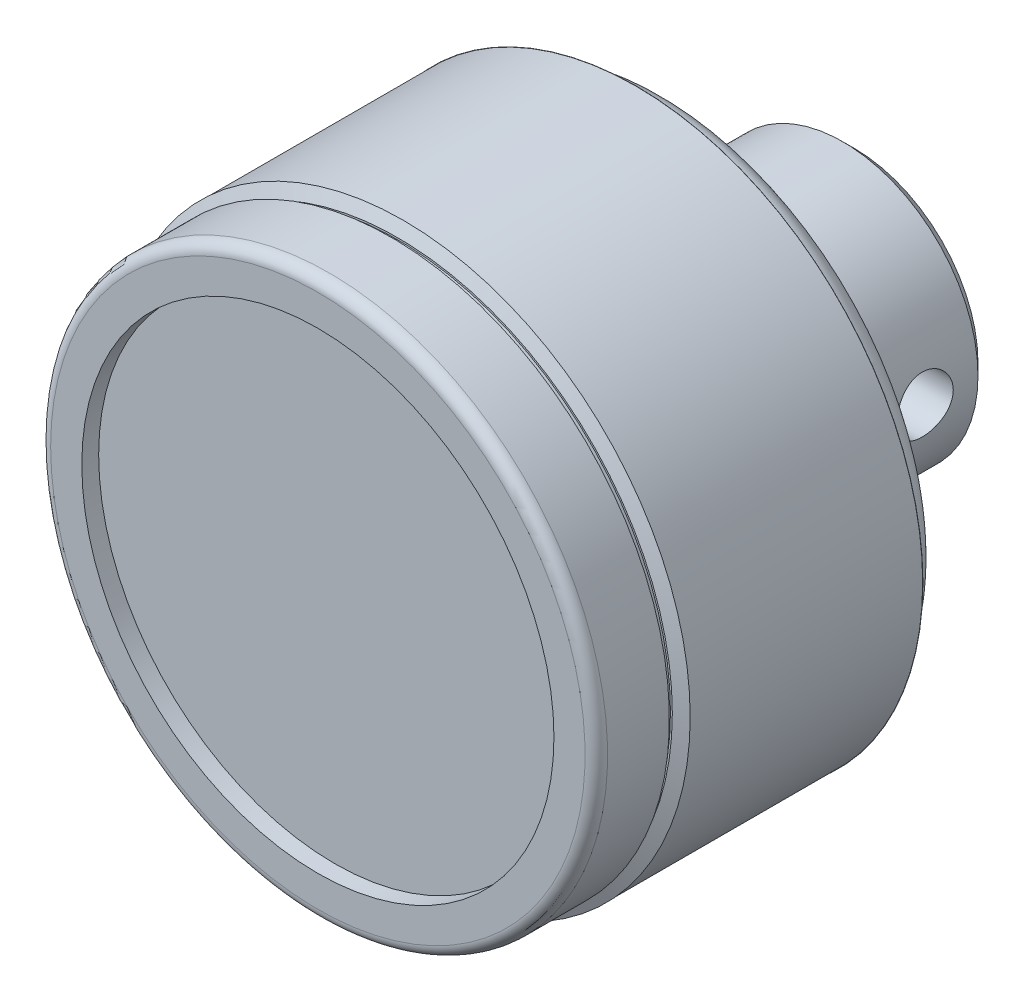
ISO-10303-21;
HEADER;
FILE_DESCRIPTION(('STEP AP214'),'2;1');
FILE_NAME('part.step','',(''),(''),'','','');
FILE_SCHEMA(('AUTOMOTIVE_DESIGN { 1 0 10303 214 1 1 1 1 }'));
ENDSEC;
DATA;
#1=APPLICATION_CONTEXT('core data for automotive mechanical design processes');
#2=APPLICATION_PROTOCOL_DEFINITION('international standard','automotive_design',2000,#1);
#3=PRODUCT_CONTEXT('',#1,'mechanical');
#4=PRODUCT('Part','Part','',(#3));
#5=PRODUCT_RELATED_PRODUCT_CATEGORY('part','',(#4));
#6=PRODUCT_DEFINITION_FORMATION('','',#4);
#7=PRODUCT_DEFINITION_CONTEXT('part definition',#1,'design');
#8=PRODUCT_DEFINITION('design','',#6,#7);
#9=PRODUCT_DEFINITION_SHAPE('','',#8);
#10=(LENGTH_UNIT() NAMED_UNIT(*) SI_UNIT(.MILLI.,.METRE.));
#11=(NAMED_UNIT(*) PLANE_ANGLE_UNIT() SI_UNIT($,.RADIAN.));
#12=(NAMED_UNIT(*) SI_UNIT($,.STERADIAN.) SOLID_ANGLE_UNIT());
#13=UNCERTAINTY_MEASURE_WITH_UNIT(LENGTH_MEASURE(1.E-05),#10,'distance_accuracy_value','');
#14=(GEOMETRIC_REPRESENTATION_CONTEXT(3) GLOBAL_UNCERTAINTY_ASSIGNED_CONTEXT((#13)) GLOBAL_UNIT_ASSIGNED_CONTEXT((#10,
#11,#12)) REPRESENTATION_CONTEXT('',''));
#15=CARTESIAN_POINT('',(0.,0.,0.));
#16=DIRECTION('',(0.,0.,1.));
#17=DIRECTION('',(1.,0.,0.));
#18=AXIS2_PLACEMENT_3D('',#15,#16,#17);
#19=CARTESIAN_POINT('',(0.,0.,47.));
#20=DIRECTION('',(0.,0.,1.));
#21=DIRECTION('',(-1.,0.,0.));
#22=AXIS2_PLACEMENT_3D('',#19,#20,#21);
#23=TOROIDAL_SURFACE('',#22,23.769615,1.);
#24=CARTESIAN_POINT('',(0.,0.,47.));
#25=DIRECTION('',(0.,0.,1.));
#26=DIRECTION('',(-1.,0.,0.));
#27=AXIS2_PLACEMENT_3D('',#24,#25,#26);
#28=CIRCLE('',#27,24.769615);
#29=CARTESIAN_POINT('',(-24.769615,0.,47.));
#30=VERTEX_POINT('',#29);
#31=EDGE_CURVE('E8',#30,#30,#28,.T.);
#32=ORIENTED_EDGE('',*,*,#31,.T.);
#33=EDGE_LOOP('',(#32));
#34=FACE_BOUND('',#33,.T.);
#35=CARTESIAN_POINT('',(0.,0.,48.));
#36=DIRECTION('',(0.,0.,1.));
#37=DIRECTION('',(-1.,0.,0.));
#38=AXIS2_PLACEMENT_3D('',#35,#36,#37);
#39=CIRCLE('',#38,23.769615);
#40=CARTESIAN_POINT('',(-23.769615,0.,48.));
#41=VERTEX_POINT('',#40);
#42=EDGE_CURVE('E78',#41,#41,#39,.T.);
#43=ORIENTED_EDGE('',*,*,#42,.F.);
#44=EDGE_LOOP('',(#43));
#45=FACE_BOUND('',#44,.T.);
#46=ADVANCED_FACE('F12',(#34,#45),#23,.T.);
#47=CARTESIAN_POINT('',(0.,0.,55.4489003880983));
#48=DIRECTION('',(0.,0.,1.));
#49=DIRECTION('',(-1.,0.,0.));
#50=AXIS2_PLACEMENT_3D('',#47,#48,#49);
#51=CYLINDRICAL_SURFACE('',#50,24.769615);
#52=CARTESIAN_POINT('',(0.,0.,41.5));
#53=DIRECTION('',(0.,0.,1.));
#54=DIRECTION('',(-1.,0.,0.));
#55=AXIS2_PLACEMENT_3D('',#52,#53,#54);
#56=CIRCLE('',#55,24.769615);
#57=CARTESIAN_POINT('',(-24.769615,0.,41.5));
#58=VERTEX_POINT('',#57);
#59=EDGE_CURVE('E24',#58,#58,#56,.T.);
#60=ORIENTED_EDGE('',*,*,#59,.T.);
#61=EDGE_LOOP('',(#60));
#62=FACE_BOUND('',#61,.T.);
#63=ORIENTED_EDGE('',*,*,#31,.F.);
#64=EDGE_LOOP('',(#63));
#65=FACE_BOUND('',#64,.T.);
#66=ADVANCED_FACE('F147',(#62,#65),#51,.T.);
#67=CARTESIAN_POINT('',(0.,24.769615,41.5));
#68=DIRECTION('',(0.,0.,-1.));
#69=DIRECTION('',(1.,0.,0.));
#70=AXIS2_PLACEMENT_3D('',#67,#68,#69);
#71=PLANE('',#70);
#72=CARTESIAN_POINT('',(0.,0.,41.5));
#73=DIRECTION('',(0.,0.,1.));
#74=DIRECTION('',(-1.,0.,0.));
#75=AXIS2_PLACEMENT_3D('',#72,#73,#74);
#76=CIRCLE('',#75,24.264145);
#77=CARTESIAN_POINT('',(-24.264145,0.,41.5));
#78=VERTEX_POINT('',#77);
#79=EDGE_CURVE('E28',#78,#78,#76,.T.);
#80=ORIENTED_EDGE('',*,*,#79,.T.);
#81=EDGE_LOOP('',(#80));
#82=FACE_BOUND('',#81,.T.);
#83=ORIENTED_EDGE('',*,*,#59,.F.);
#84=EDGE_LOOP('',(#83));
#85=FACE_BOUND('',#84,.T.);
#86=ADVANCED_FACE('F152',(#82,#85),#71,.T.);
#87=CARTESIAN_POINT('',(0.,0.,55.4489003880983));
#88=DIRECTION('',(0.,0.,1.));
#89=DIRECTION('',(-1.,0.,0.));
#90=AXIS2_PLACEMENT_3D('',#87,#88,#89);
#91=CYLINDRICAL_SURFACE('',#90,24.264145);
#92=CARTESIAN_POINT('',(0.,0.,40.9));
#93=DIRECTION('',(0.,0.,1.));
#94=DIRECTION('',(-1.,0.,0.));
#95=AXIS2_PLACEMENT_3D('',#92,#93,#94);
#96=CIRCLE('',#95,24.264145);
#97=CARTESIAN_POINT('',(-24.264145,0.,40.9));
#98=VERTEX_POINT('',#97);
#99=EDGE_CURVE('E33',#98,#98,#96,.T.);
#100=ORIENTED_EDGE('',*,*,#99,.T.);
#101=EDGE_LOOP('',(#100));
#102=FACE_BOUND('',#101,.T.);
#103=ORIENTED_EDGE('',*,*,#79,.F.);
#104=EDGE_LOOP('',(#103));
#105=FACE_BOUND('',#104,.T.);
#106=ADVANCED_FACE('F161',(#102,#105),#91,.T.);
#107=CARTESIAN_POINT('',(0.,24.430602,40.9));
#108=DIRECTION('',(0.,0.,-1.));
#109=DIRECTION('',(1.,0.,0.));
#110=AXIS2_PLACEMENT_3D('',#107,#108,#109);
#111=PLANE('',#110);
#112=ORIENTED_EDGE('',*,*,#99,.F.);
#113=EDGE_LOOP('',(#112));
#114=FACE_BOUND('',#113,.T.);
#115=CARTESIAN_POINT('',(0.,0.,40.9));
#116=DIRECTION('',(0.,0.,1.));
#117=DIRECTION('',(-1.,0.,0.));
#118=AXIS2_PLACEMENT_3D('',#115,#116,#117);
#119=CIRCLE('',#118,24.430602);
#120=CARTESIAN_POINT('',(-24.430602,0.,40.9));
#121=VERTEX_POINT('',#120);
#122=EDGE_CURVE('E36',#121,#121,#119,.T.);
#123=ORIENTED_EDGE('',*,*,#122,.T.);
#124=EDGE_LOOP('',(#123));
#125=FACE_BOUND('',#124,.T.);
#126=ADVANCED_FACE('F168',(#114,#125),#111,.F.);
#127=CARTESIAN_POINT('',(0.,0.,40.9));
#128=DIRECTION('',(0.,0.,-1.));
#129=DIRECTION('',(1.,0.,0.));
#130=AXIS2_PLACEMENT_3D('',#127,#128,#129);
#131=CONICAL_SURFACE('',#130,24.430602,1.14037477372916);
#132=CARTESIAN_POINT('',(0.,0.,40.4));
#133=DIRECTION('',(0.,0.,1.));
#134=DIRECTION('',(-1.,0.,0.));
#135=AXIS2_PLACEMENT_3D('',#132,#133,#134);
#136=CIRCLE('',#135,25.519615);
#137=CARTESIAN_POINT('',(-25.519615,0.,40.4));
#138=VERTEX_POINT('',#137);
#139=EDGE_CURVE('E39',#138,#138,#136,.T.);
#140=ORIENTED_EDGE('',*,*,#139,.T.);
#141=EDGE_LOOP('',(#140));
#142=FACE_BOUND('',#141,.T.);
#143=ORIENTED_EDGE('',*,*,#122,.F.);
#144=EDGE_LOOP('',(#143));
#145=FACE_BOUND('',#144,.T.);
#146=ADVANCED_FACE('F172',(#142,#145),#131,.T.);
#147=CARTESIAN_POINT('',(0.,25.5,40.4));
#148=DIRECTION('',(0.,0.,1.));
#149=DIRECTION('',(-1.,0.,0.));
#150=AXIS2_PLACEMENT_3D('',#147,#148,#149);
#151=PLANE('',#150);
#152=ORIENTED_EDGE('',*,*,#139,.F.);
#153=EDGE_LOOP('',(#152));
#154=FACE_BOUND('',#153,.T.);
#155=CARTESIAN_POINT('',(0.,0.,40.4));
#156=DIRECTION('',(0.,0.,1.));
#157=DIRECTION('',(-1.,0.,0.));
#158=AXIS2_PLACEMENT_3D('',#155,#156,#157);
#159=CIRCLE('',#158,25.5);
#160=CARTESIAN_POINT('',(-25.5,0.,40.4));
#161=VERTEX_POINT('',#160);
#162=EDGE_CURVE('E42',#161,#161,#159,.T.);
#163=ORIENTED_EDGE('',*,*,#162,.T.);
#164=EDGE_LOOP('',(#163));
#165=FACE_BOUND('',#164,.T.);
#166=ADVANCED_FACE('F176',(#154,#165),#151,.F.);
#167=CARTESIAN_POINT('',(0.,0.,55.4489003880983));
#168=DIRECTION('',(0.,0.,1.));
#169=DIRECTION('',(-1.,0.,0.));
#170=AXIS2_PLACEMENT_3D('',#167,#168,#169);
#171=CYLINDRICAL_SURFACE('',#170,25.5);
#172=CARTESIAN_POINT('',(0.,0.,19.7));
#173=DIRECTION('',(0.,0.,1.));
#174=DIRECTION('',(-1.,0.,0.));
#175=AXIS2_PLACEMENT_3D('',#172,#173,#174);
#176=CIRCLE('',#175,25.5);
#177=CARTESIAN_POINT('',(-25.5,0.,19.7));
#178=VERTEX_POINT('',#177);
#179=EDGE_CURVE('E45',#178,#178,#176,.T.);
#180=ORIENTED_EDGE('',*,*,#179,.T.);
#181=EDGE_LOOP('',(#180));
#182=FACE_BOUND('',#181,.T.);
#183=ORIENTED_EDGE('',*,*,#162,.F.);
#184=EDGE_LOOP('',(#183));
#185=FACE_BOUND('',#184,.T.);
#186=ADVANCED_FACE('F180',(#182,#185),#171,.T.);
#187=CARTESIAN_POINT('',(0.,25.5,19.7));
#188=DIRECTION('',(0.,0.,1.));
#189=DIRECTION('',(-1.,0.,0.));
#190=AXIS2_PLACEMENT_3D('',#187,#188,#189);
#191=PLANE('',#190);
#192=CARTESIAN_POINT('',(0.,0.,19.7));
#193=DIRECTION('',(0.,0.,1.));
#194=DIRECTION('',(-1.,0.,0.));
#195=AXIS2_PLACEMENT_3D('',#192,#193,#194);
#196=CIRCLE('',#195,25.519615);
#197=CARTESIAN_POINT('',(-25.519615,0.,19.7));
#198=VERTEX_POINT('',#197);
#199=EDGE_CURVE('E48',#198,#198,#196,.T.);
#200=ORIENTED_EDGE('',*,*,#199,.T.);
#201=EDGE_LOOP('',(#200));
#202=FACE_BOUND('',#201,.T.);
#203=ORIENTED_EDGE('',*,*,#179,.F.);
#204=EDGE_LOOP('',(#203));
#205=FACE_BOUND('',#204,.T.);
#206=ADVANCED_FACE('F184',(#202,#205),#191,.T.);
#207=CARTESIAN_POINT('',(0.,0.,19.7));
#208=DIRECTION('',(0.,0.,1.));
#209=DIRECTION('',(-1.,0.,0.));
#210=AXIS2_PLACEMENT_3D('',#207,#208,#209);
#211=CONICAL_SURFACE('',#210,25.519615,1.1165546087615);
#212=CARTESIAN_POINT('',(0.,0.,19.0860529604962));
#213=DIRECTION('',(0.,0.,1.));
#214=DIRECTION('',(-1.,0.,0.));
#215=AXIS2_PLACEMENT_3D('',#212,#213,#214);
#216=CIRCLE('',#215,24.2622928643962);
#217=CARTESIAN_POINT('',(-24.2622928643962,0.,19.0860529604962));
#218=VERTEX_POINT('',#217);
#219=EDGE_CURVE('E51',#218,#218,#216,.T.);
#220=ORIENTED_EDGE('',*,*,#219,.T.);
#221=EDGE_LOOP('',(#220));
#222=FACE_BOUND('',#221,.T.);
#223=ORIENTED_EDGE('',*,*,#199,.F.);
#224=EDGE_LOOP('',(#223));
#225=FACE_BOUND('',#224,.T.);
#226=ADVANCED_FACE('F188',(#222,#225),#211,.T.);
#227=CARTESIAN_POINT('',(0.,0.,19.));
#228=DIRECTION('',(0.,0.,1.));
#229=DIRECTION('',(-1.,0.,0.));
#230=AXIS2_PLACEMENT_3D('',#227,#228,#229);
#231=TOROIDAL_SURFACE('',#230,22.264145,2.0000000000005);
#232=CARTESIAN_POINT('',(0.,0.,17.));
#233=DIRECTION('',(0.,0.,1.));
#234=DIRECTION('',(-1.,0.,0.));
#235=AXIS2_PLACEMENT_3D('',#232,#233,#234);
#236=CIRCLE('',#235,22.264147);
#237=CARTESIAN_POINT('',(-22.264147,0.,17.));
#238=VERTEX_POINT('',#237);
#239=EDGE_CURVE('E54',#238,#238,#236,.T.);
#240=ORIENTED_EDGE('',*,*,#239,.T.);
#241=EDGE_LOOP('',(#240));
#242=FACE_BOUND('',#241,.T.);
#243=ORIENTED_EDGE('',*,*,#219,.F.);
#244=EDGE_LOOP('',(#243));
#245=FACE_BOUND('',#244,.T.);
#246=ADVANCED_FACE('F192',(#242,#245),#231,.T.);
#247=CARTESIAN_POINT('',(0.,15.019615,17.));
#248=DIRECTION('',(0.,0.,1.));
#249=DIRECTION('',(-1.,0.,0.));
#250=AXIS2_PLACEMENT_3D('',#247,#248,#249);
#251=PLANE('',#250);
#252=ORIENTED_EDGE('',*,*,#239,.F.);
#253=EDGE_LOOP('',(#252));
#254=FACE_BOUND('',#253,.T.);
#255=CARTESIAN_POINT('',(0.,0.,17.));
#256=DIRECTION('',(0.,0.,1.));
#257=DIRECTION('',(-1.,0.,0.));
#258=AXIS2_PLACEMENT_3D('',#255,#256,#257);
#259=CIRCLE('',#258,15.019615);
#260=CARTESIAN_POINT('',(-15.019615,0.,17.));
#261=VERTEX_POINT('',#260);
#262=EDGE_CURVE('E57',#261,#261,#259,.T.);
#263=ORIENTED_EDGE('',*,*,#262,.T.);
#264=EDGE_LOOP('',(#263));
#265=FACE_BOUND('',#264,.T.);
#266=ADVANCED_FACE('F196',(#254,#265),#251,.F.);
#267=CARTESIAN_POINT('',(0.,0.,14.));
#268=DIRECTION('',(0.,0.,1.));
#269=DIRECTION('',(-1.,0.,0.));
#270=AXIS2_PLACEMENT_3D('',#267,#268,#269);
#271=TOROIDAL_SURFACE('',#270,15.019615,3.);
#272=ORIENTED_EDGE('',*,*,#262,.F.);
#273=EDGE_LOOP('',(#272));
#274=FACE_BOUND('',#273,.T.);
#275=CARTESIAN_POINT('',(0.,0.,14.));
#276=DIRECTION('',(0.,0.,1.));
#277=DIRECTION('',(-1.,0.,0.));
#278=AXIS2_PLACEMENT_3D('',#275,#276,#277);
#279=CIRCLE('',#278,12.019615);
#280=CARTESIAN_POINT('',(-12.019615,0.,14.));
#281=VERTEX_POINT('',#280);
#282=EDGE_CURVE('E60',#281,#281,#279,.T.);
#283=ORIENTED_EDGE('',*,*,#282,.T.);
#284=EDGE_LOOP('',(#283));
#285=FACE_BOUND('',#284,.T.);
#286=ADVANCED_FACE('F142',(#274,#285),#271,.F.);
#287=CARTESIAN_POINT('',(0.,0.,55.4489003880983));
#288=DIRECTION('',(0.,0.,1.));
#289=DIRECTION('',(-1.,0.,0.));
#290=AXIS2_PLACEMENT_3D('',#287,#288,#289);
#291=CYLINDRICAL_SURFACE('',#290,12.019615);
#292=CARTESIAN_POINT('',(12.019615,0.,3.5));
#293=CARTESIAN_POINT('',(12.0196124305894,0.138823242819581,3.50000496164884));
#294=CARTESIAN_POINT('',(12.0171853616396,0.27770803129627,3.51160219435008));
#295=CARTESIAN_POINT('',(12.0077375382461,0.551543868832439,3.55764316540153));
#296=CARTESIAN_POINT('',(12.0007132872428,0.686491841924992,3.59210429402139));
#297=CARTESIAN_POINT('',(11.9828545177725,0.94845596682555,3.68275595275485));
#298=CARTESIAN_POINT('',(11.9720237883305,1.07547985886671,3.73892488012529));
#299=CARTESIAN_POINT('',(11.9477259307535,1.31829380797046,3.87133166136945));
#300=CARTESIAN_POINT('',(11.9342589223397,1.43408437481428,3.94756860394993));
#301=CARTESIAN_POINT('',(11.9059481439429,1.65284104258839,4.11912557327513));
#302=CARTESIAN_POINT('',(11.8910886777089,1.75561970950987,4.21468203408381));
#303=CARTESIAN_POINT('',(11.8617804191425,1.94381114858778,4.42165755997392));
#304=CARTESIAN_POINT('',(11.8473316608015,2.02922248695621,4.53307793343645));
#305=CARTESIAN_POINT('',(11.820326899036,2.18106471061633,4.7699824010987));
#306=CARTESIAN_POINT('',(11.8077910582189,2.24729924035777,4.8955948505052));
#307=CARTESIAN_POINT('',(11.7862554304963,2.35764910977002,5.15647016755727));
#308=CARTESIAN_POINT('',(11.7772552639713,2.40176682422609,5.29173199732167));
#309=CARTESIAN_POINT('',(11.7639692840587,2.4660176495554,5.56604282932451));
#310=CARTESIAN_POINT('',(11.7596186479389,2.48648088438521,5.70501130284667));
#311=CARTESIAN_POINT('',(11.7559293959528,2.50386772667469,5.98447180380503));
#312=CARTESIAN_POINT('',(11.7565902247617,2.50079394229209,6.12496366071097));
#313=CARTESIAN_POINT('',(11.7627904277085,2.47146038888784,6.4010515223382));
#314=CARTESIAN_POINT('',(11.7682497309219,2.44558115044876,6.53669002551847));
#315=CARTESIAN_POINT('',(11.7833054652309,2.37197288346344,6.80165713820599));
#316=CARTESIAN_POINT('',(11.7929021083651,2.32424273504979,6.93098542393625));
#317=CARTESIAN_POINT('',(11.815231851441,2.20793001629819,7.1807463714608));
#318=CARTESIAN_POINT('',(11.8279872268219,2.13919850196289,7.30110759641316));
#319=CARTESIAN_POINT('',(11.8551831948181,1.9829390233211,7.52873024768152));
#320=CARTESIAN_POINT('',(11.8696239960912,1.89540873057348,7.63599004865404));
#321=CARTESIAN_POINT('',(11.8989092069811,1.70200854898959,7.83655887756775));
#322=CARTESIAN_POINT('',(11.913755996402,1.59581437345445,7.92955514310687));
#323=CARTESIAN_POINT('',(11.9419231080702,1.36917356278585,8.09646603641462));
#324=CARTESIAN_POINT('',(11.9552434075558,1.2487267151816,8.17038037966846));
#325=CARTESIAN_POINT('',(11.9788936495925,0.996637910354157,8.29709516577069));
#326=CARTESIAN_POINT('',(11.9892182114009,0.864976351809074,8.34985768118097));
#327=CARTESIAN_POINT('',(12.005673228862,0.594394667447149,8.43242589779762));
#328=CARTESIAN_POINT('',(12.0118042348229,0.455475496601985,8.46223461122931));
#329=CARTESIAN_POINT('',(12.0191039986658,0.177007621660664,8.49760122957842));
#330=CARTESIAN_POINT('',(12.0203602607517,0.0375154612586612,8.50358682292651));
#331=CARTESIAN_POINT('',(12.0180129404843,-0.240475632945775,8.49229219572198));
#332=CARTESIAN_POINT('',(12.0144096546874,-0.378974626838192,8.47501339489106));
#333=CARTESIAN_POINT('',(12.0028030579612,-0.649652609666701,8.41803553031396));
#334=CARTESIAN_POINT('',(11.9948432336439,-0.781880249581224,8.37855794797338));
#335=CARTESIAN_POINT('',(11.9754134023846,-1.03783835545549,8.278546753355));
#336=CARTESIAN_POINT('',(11.9639431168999,-1.16156814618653,8.21801147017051));
#337=CARTESIAN_POINT('',(11.9385475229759,-1.39880742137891,8.07669226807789));
#338=CARTESIAN_POINT('',(11.9245920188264,-1.51216176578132,7.99565345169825));
#339=CARTESIAN_POINT('',(11.8958409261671,-1.72381618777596,7.81596650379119));
#340=CARTESIAN_POINT('',(11.8810452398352,-1.82211450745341,7.71731631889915));
#341=CARTESIAN_POINT('',(11.8519833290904,-2.00253408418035,7.50325324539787));
#342=CARTESIAN_POINT('',(11.837729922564,-2.08436063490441,7.38758991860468));
#343=CARTESIAN_POINT('',(11.8116478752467,-2.22742655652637,7.14390987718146));
#344=CARTESIAN_POINT('',(11.7998191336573,-2.28866678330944,7.01589367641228));
#345=CARTESIAN_POINT('',(11.7800312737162,-2.388429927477,6.7518073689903));
#346=CARTESIAN_POINT('',(11.7720513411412,-2.42707528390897,6.61578515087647));
#347=CARTESIAN_POINT('',(11.7608230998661,-2.48091815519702,6.33899252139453));
#348=CARTESIAN_POINT('',(11.7575741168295,-2.49611901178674,6.19822278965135));
#349=CARTESIAN_POINT('',(11.7562152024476,-2.50250989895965,5.91889501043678));
#350=CARTESIAN_POINT('',(11.758005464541,-2.49416624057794,5.78034790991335));
#351=CARTESIAN_POINT('',(11.7662991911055,-2.45473964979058,5.50667909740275));
#352=CARTESIAN_POINT('',(11.7728026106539,-2.42365693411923,5.37155735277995));
#353=CARTESIAN_POINT('',(11.7897435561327,-2.33984988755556,5.10890229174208));
#354=CARTESIAN_POINT('',(11.8001698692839,-2.28718720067,4.98134853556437));
#355=CARTESIAN_POINT('',(11.823787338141,-2.16177052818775,4.73681555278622));
#356=CARTESIAN_POINT('',(11.8369787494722,-2.08901468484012,4.61983730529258));
#357=CARTESIAN_POINT('',(11.8649424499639,-1.92390346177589,4.3974635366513));
#358=CARTESIAN_POINT('',(11.8797392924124,-1.83121314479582,4.29231974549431));
#359=CARTESIAN_POINT('',(11.9090751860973,-1.62955045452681,4.09892488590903));
#360=CARTESIAN_POINT('',(11.9236141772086,-1.52057433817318,4.01067771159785));
#361=CARTESIAN_POINT('',(11.9509936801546,-1.2879270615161,3.85261798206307));
#362=CARTESIAN_POINT('',(11.9638127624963,-1.16410147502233,3.7830288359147));
#363=CARTESIAN_POINT('',(11.9860956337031,-0.906276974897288,3.66575889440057));
#364=CARTESIAN_POINT('',(11.9955623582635,-0.772287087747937,3.61805891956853));
#365=CARTESIAN_POINT('',(12.0082968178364,-0.531719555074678,3.55485453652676));
#366=CARTESIAN_POINT('',(12.0125156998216,-0.426484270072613,3.53432181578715));
#367=CARTESIAN_POINT('',(12.0181757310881,-0.21417815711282,3.50689288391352));
#368=CARTESIAN_POINT('',(12.0196169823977,-0.107107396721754,3.49999617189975));
#369=CARTESIAN_POINT('',(12.019615,0.,3.5));
#370=B_SPLINE_CURVE_WITH_KNOTS('',3,(#292,#293,#294,#295,#296,#297,#298,#299,#300,#301,#302,
#303,#304,#305,#306,#307,#308,#309,#310,#311,#312,#313,#314,#315,#316,#317,#318,#319,#320,#321,
#322,#323,#324,#325,#326,#327,#328,#329,#330,#331,#332,#333,#334,#335,#336,#337,#338,#339,#340,
#341,#342,#343,#344,#345,#346,#347,#348,#349,#350,#351,#352,#353,#354,#355,#356,#357,#358,#359,
#360,#361,#362,#363,#364,#365,#366,#367,#368,#369),.UNSPECIFIED.,.T.,.F.,(4,2,2,2,2,2,2,2,2,2,2,
2,2,2,2,2,2,2,2,2,2,2,2,2,2,2,2,2,2,2,2,2,2,2,2,2,2,2,4),(0.,0.416077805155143,
0.832472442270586,1.2484537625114,1.66441619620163,2.08581626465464,2.50725110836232,
2.93285974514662,3.35842267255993,3.77797183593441,4.19747450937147,4.6101071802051,
5.02276100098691,5.43841214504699,5.85411480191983,6.27792221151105,6.70173593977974,
7.12630624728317,7.5508208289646,7.96767891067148,8.38451155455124,8.79725734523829,
9.21003589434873,9.62822247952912,10.0464578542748,10.4716161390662,10.8967567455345,
11.3195716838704,11.7423263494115,12.156767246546,12.5712041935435,12.984465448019,
13.3977649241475,13.818643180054,14.239618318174,14.6654293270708,15.0908665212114,
15.4118981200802,15.732917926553),.UNSPECIFIED.);
#371=CARTESIAN_POINT('',(12.019615,0.,3.5));
#372=VERTEX_POINT('',#371);
#373=EDGE_CURVE('E87',#372,#372,#370,.T.);
#374=ORIENTED_EDGE('',*,*,#373,.F.);
#375=EDGE_LOOP('',(#374));
#376=FACE_BOUND('',#375,.T.);
#377=CARTESIAN_POINT('',(0.,0.,1.3));
#378=DIRECTION('',(0.,0.,1.));
#379=DIRECTION('',(-1.,0.,0.));
#380=AXIS2_PLACEMENT_3D('',#377,#378,#379);
#381=CIRCLE('',#380,12.019615);
#382=CARTESIAN_POINT('',(-12.019615,0.,1.3));
#383=VERTEX_POINT('',#382);
#384=EDGE_CURVE('E63',#383,#383,#381,.T.);
#385=ORIENTED_EDGE('',*,*,#384,.T.);
#386=EDGE_LOOP('',(#385));
#387=FACE_BOUND('',#386,.T.);
#388=ORIENTED_EDGE('',*,*,#282,.F.);
#389=EDGE_LOOP('',(#388));
#390=FACE_BOUND('',#389,.T.);
#391=ADVANCED_FACE('F95',(#376,#387,#390),#291,.T.);
#392=CARTESIAN_POINT('',(0.,0.,0.299999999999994));
#393=DIRECTION('',(0.,0.,1.));
#394=DIRECTION('',(-1.,0.,0.));
#395=AXIS2_PLACEMENT_3D('',#392,#393,#394);
#396=CONICAL_SURFACE('',#395,11.019615,0.785398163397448);
#397=ORIENTED_EDGE('',*,*,#384,.F.);
#398=EDGE_LOOP('',(#397));
#399=FACE_BOUND('',#398,.T.);
#400=CARTESIAN_POINT('',(0.,0.,0.299999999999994));
#401=DIRECTION('',(0.,0.,1.));
#402=DIRECTION('',(-1.,0.,0.));
#403=AXIS2_PLACEMENT_3D('',#400,#401,#402);
#404=CIRCLE('',#403,11.019615);
#405=CARTESIAN_POINT('',(-11.019615,0.,0.299999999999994));
#406=VERTEX_POINT('',#405);
#407=EDGE_CURVE('E66',#406,#406,#404,.T.);
#408=ORIENTED_EDGE('',*,*,#407,.T.);
#409=EDGE_LOOP('',(#408));
#410=FACE_BOUND('',#409,.T.);
#411=ADVANCED_FACE('F133',(#399,#410),#396,.T.);
#412=CARTESIAN_POINT('',(0.,9.019615,0.299999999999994));
#413=DIRECTION('',(0.,0.,1.));
#414=DIRECTION('',(-1.,0.,0.));
#415=AXIS2_PLACEMENT_3D('',#412,#413,#414);
#416=PLANE('',#415);
#417=ORIENTED_EDGE('',*,*,#407,.F.);
#418=EDGE_LOOP('',(#417));
#419=FACE_BOUND('',#418,.T.);
#420=CARTESIAN_POINT('',(0.,0.,0.299999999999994));
#421=DIRECTION('',(0.,0.,1.));
#422=DIRECTION('',(-1.,0.,0.));
#423=AXIS2_PLACEMENT_3D('',#420,#421,#422);
#424=CIRCLE('',#423,9.019615);
#425=CARTESIAN_POINT('',(-9.019615,0.,0.299999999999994));
#426=VERTEX_POINT('',#425);
#427=EDGE_CURVE('E69',#426,#426,#424,.T.);
#428=ORIENTED_EDGE('',*,*,#427,.T.);
#429=EDGE_LOOP('',(#428));
#430=FACE_BOUND('',#429,.T.);
#431=ADVANCED_FACE('F130',(#419,#430),#416,.F.);
#432=CARTESIAN_POINT('',(0.,0.,55.4489003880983));
#433=DIRECTION('',(0.,0.,1.));
#434=DIRECTION('',(-1.,0.,0.));
#435=AXIS2_PLACEMENT_3D('',#432,#433,#434);
#436=CYLINDRICAL_SURFACE('',#435,9.019615);
#437=CARTESIAN_POINT('',(0.,0.,0.));
#438=DIRECTION('',(0.,0.,1.));
#439=DIRECTION('',(-1.,0.,0.));
#440=AXIS2_PLACEMENT_3D('',#437,#438,#439);
#441=CIRCLE('',#440,9.019615);
#442=CARTESIAN_POINT('',(-9.019615,0.,0.));
#443=VERTEX_POINT('',#442);
#444=EDGE_CURVE('E72',#443,#443,#441,.T.);
#445=ORIENTED_EDGE('',*,*,#444,.T.);
#446=EDGE_LOOP('',(#445));
#447=FACE_BOUND('',#446,.T.);
#448=ORIENTED_EDGE('',*,*,#427,.F.);
#449=EDGE_LOOP('',(#448));
#450=FACE_BOUND('',#449,.T.);
#451=ADVANCED_FACE('F126',(#447,#450),#436,.T.);
#452=CARTESIAN_POINT('',(0.,4.,0.));
#453=DIRECTION('',(0.,0.,1.));
#454=DIRECTION('',(-1.,0.,0.));
#455=AXIS2_PLACEMENT_3D('',#452,#453,#454);
#456=PLANE('',#455);
#457=ORIENTED_EDGE('',*,*,#444,.F.);
#458=EDGE_LOOP('',(#457));
#459=FACE_BOUND('',#458,.T.);
#460=CARTESIAN_POINT('',(0.,0.,0.));
#461=DIRECTION('',(0.,0.,1.));
#462=DIRECTION('',(-1.,0.,0.));
#463=AXIS2_PLACEMENT_3D('',#460,#461,#462);
#464=CIRCLE('',#463,4.);
#465=CARTESIAN_POINT('',(-4.,0.,0.));
#466=VERTEX_POINT('',#465);
#467=EDGE_CURVE('E75',#466,#466,#464,.T.);
#468=ORIENTED_EDGE('',*,*,#467,.T.);
#469=EDGE_LOOP('',(#468));
#470=FACE_BOUND('',#469,.T.);
#471=ADVANCED_FACE('F122',(#459,#470),#456,.F.);
#472=CARTESIAN_POINT('',(0.,0.,55.4489003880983));
#473=DIRECTION('',(0.,0.,1.));
#474=DIRECTION('',(-1.,0.,0.));
#475=AXIS2_PLACEMENT_3D('',#472,#473,#474);
#476=CYLINDRICAL_SURFACE('',#475,4.);
#477=CARTESIAN_POINT('',(0.,0.,17.));
#478=DIRECTION('',(0.,0.,-1.));
#479=DIRECTION('',(-1.,0.,0.));
#480=AXIS2_PLACEMENT_3D('',#477,#478,#479);
#481=CIRCLE('',#480,4.);
#482=CARTESIAN_POINT('',(-4.,0.,17.));
#483=VERTEX_POINT('',#482);
#484=EDGE_CURVE('E94',#483,#483,#481,.T.);
#485=ORIENTED_EDGE('',*,*,#484,.F.);
#486=EDGE_LOOP('',(#485));
#487=FACE_BOUND('',#486,.T.);
#488=CARTESIAN_POINT('',(4.,0.,3.5));
#489=CARTESIAN_POINT('',(3.99999041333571,0.127017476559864,3.50001047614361));
#490=CARTESIAN_POINT('',(3.9938860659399,0.254191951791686,3.50974649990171));
#491=CARTESIAN_POINT('',(3.97004375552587,0.504637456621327,3.54817112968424));
#492=CARTESIAN_POINT('',(3.95228361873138,0.627900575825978,3.57689586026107));
#493=CARTESIAN_POINT('',(3.90691695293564,0.86641086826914,3.65162285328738));
#494=CARTESIAN_POINT('',(3.87935918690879,0.981694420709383,3.69753960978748));
#495=CARTESIAN_POINT('',(3.81669199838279,1.20252080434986,3.80477166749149));
#496=CARTESIAN_POINT('',(3.78158341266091,1.30806471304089,3.86608526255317));
#497=CARTESIAN_POINT('',(3.70340304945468,1.5159483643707,4.00777315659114));
#498=CARTESIAN_POINT('',(3.65991924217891,1.61735911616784,4.08927860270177));
#499=CARTESIAN_POINT('',(3.57062700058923,1.80597275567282,4.26643834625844));
#500=CARTESIAN_POINT('',(3.52481549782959,1.89315621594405,4.36211165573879));
#501=CARTESIAN_POINT('',(3.42860837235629,2.06285746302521,4.58006778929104));
#502=CARTESIAN_POINT('',(3.3784322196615,2.14314412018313,4.70419957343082));
#503=CARTESIAN_POINT('',(3.28660396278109,2.28147932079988,4.96712963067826));
#504=CARTESIAN_POINT('',(3.24493752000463,2.33956541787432,5.10590262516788));
#505=CARTESIAN_POINT('',(3.18619151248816,2.41866801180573,5.35762104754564));
#506=CARTESIAN_POINT('',(3.16553811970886,2.44539104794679,5.46793363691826));
#507=CARTESIAN_POINT('',(3.13562714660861,2.4836368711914,5.69261185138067));
#508=CARTESIAN_POINT('',(3.12635347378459,2.49518112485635,5.80697151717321));
#509=CARTESIAN_POINT('',(3.12059771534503,2.50237836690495,6.03682603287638));
#510=CARTESIAN_POINT('',(3.12414917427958,2.49798968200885,6.15232307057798));
#511=CARTESIAN_POINT('',(3.14354804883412,2.47352633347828,6.38062020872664));
#512=CARTESIAN_POINT('',(3.15940531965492,2.45343909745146,6.49341807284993));
#513=CARTESIAN_POINT('',(3.2006514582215,2.39936209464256,6.71087689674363));
#514=CARTESIAN_POINT('',(3.22581428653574,2.36570043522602,6.81566487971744));
#515=CARTESIAN_POINT('',(3.28291134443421,2.28580369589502,7.01832239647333));
#516=CARTESIAN_POINT('',(3.31484796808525,2.2395641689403,7.11618946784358));
#517=CARTESIAN_POINT('',(3.38909625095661,2.12589830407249,7.32166640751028));
#518=CARTESIAN_POINT('',(3.43223155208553,2.05612773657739,7.42768105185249));
#519=CARTESIAN_POINT('',(3.52011451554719,1.90176111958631,7.62766112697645));
#520=CARTESIAN_POINT('',(3.56486379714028,1.81714983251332,7.72161400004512));
#521=CARTESIAN_POINT('',(3.65959667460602,1.61904732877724,7.91060100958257));
#522=CARTESIAN_POINT('',(3.70922571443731,1.5030944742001,8.00325594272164));
#523=CARTESIAN_POINT('',(3.80056601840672,1.25426444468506,8.16771179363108));
#524=CARTESIAN_POINT('',(3.84228039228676,1.12139395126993,8.23952090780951));
#525=CARTESIAN_POINT('',(3.89435975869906,0.915775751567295,8.32734595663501));
#526=CARTESIAN_POINT('',(3.90966874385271,0.848193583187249,8.35283428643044));
#527=CARTESIAN_POINT('',(3.93701839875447,0.710492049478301,8.39800765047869));
#528=CARTESIAN_POINT('',(3.94906095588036,0.640374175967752,8.41769603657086));
#529=CARTESIAN_POINT('',(3.96949699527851,0.498239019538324,8.45093416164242));
#530=CARTESIAN_POINT('',(3.97789374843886,0.42622350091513,8.464489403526));
#531=CARTESIAN_POINT('',(3.99078766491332,0.280965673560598,8.4852462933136));
#532=CARTESIAN_POINT('',(3.99528549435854,0.207723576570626,8.49244902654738));
#533=CARTESIAN_POINT('',(4.00193773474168,0.00911917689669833,8.50310930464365));
#534=CARTESIAN_POINT('',(4.000238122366,-0.116782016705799,8.50040036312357));
#535=CARTESIAN_POINT('',(3.98518313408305,-0.36596776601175,8.47624033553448));
#536=CARTESIAN_POINT('',(3.97182855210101,-0.489252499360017,8.45479052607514));
#537=CARTESIAN_POINT('',(3.93547975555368,-0.72503619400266,8.39552141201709));
#538=CARTESIAN_POINT('',(3.91288306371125,-0.83776842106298,8.35837527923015));
#539=CARTESIAN_POINT('',(3.85991402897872,-1.05527816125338,8.26940762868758));
#540=CARTESIAN_POINT('',(3.82954038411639,-1.16005433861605,8.2175836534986));
#541=CARTESIAN_POINT('',(3.75980014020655,-1.37016761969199,8.0949694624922));
#542=CARTESIAN_POINT('',(3.71983526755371,-1.47449380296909,8.02279282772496));
#543=CARTESIAN_POINT('',(3.63613942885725,-1.67028541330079,7.86441230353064));
#544=CARTESIAN_POINT('',(3.59240430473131,-1.76173634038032,7.77819283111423));
#545=CARTESIAN_POINT('',(3.49811738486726,-1.9429483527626,7.57972991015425));
#546=CARTESIAN_POINT('',(3.44749766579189,-2.03053702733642,7.46552558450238));
#547=CARTESIAN_POINT('',(3.35133525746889,-2.18560704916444,7.22224843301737));
#548=CARTESIAN_POINT('',(3.30578906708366,-2.25310231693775,7.09318598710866));
#549=CARTESIAN_POINT('',(3.23467060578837,-2.35369543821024,6.85061570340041));
#550=CARTESIAN_POINT('',(3.20691272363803,-2.39103791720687,6.73951849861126));
#551=CARTESIAN_POINT('',(3.16210061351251,-2.45000216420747,6.51121370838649));
#552=CARTESIAN_POINT('',(3.14502966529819,-2.47164849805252,6.39401598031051));
#553=CARTESIAN_POINT('',(3.124126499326,-2.49802767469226,6.15581944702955));
#554=CARTESIAN_POINT('',(3.12037003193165,-2.50266374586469,6.03480283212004));
#555=CARTESIAN_POINT('',(3.12698126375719,-2.49439556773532,5.79373807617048));
#556=CARTESIAN_POINT('',(3.13735365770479,-2.48148548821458,5.67369027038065));
#557=CARTESIAN_POINT('',(3.1691077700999,-2.44076547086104,5.44794042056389));
#558=CARTESIAN_POINT('',(3.18953614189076,-2.41423847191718,5.34186143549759));
#559=CARTESIAN_POINT('',(3.23835062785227,-2.34835238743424,5.13572984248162));
#560=CARTESIAN_POINT('',(3.26674005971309,-2.30898795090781,5.03567976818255));
#561=CARTESIAN_POINT('',(3.33327797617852,-2.2120541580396,4.82880667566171));
#562=CARTESIAN_POINT('',(3.3722442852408,-2.15267427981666,4.72310005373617));
#563=CARTESIAN_POINT('',(3.45335445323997,-2.01999894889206,4.52212261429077));
#564=CARTESIAN_POINT('',(3.49550086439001,-1.94669224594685,4.42686033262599));
#565=CARTESIAN_POINT('',(3.5880367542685,-1.77134669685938,4.22997441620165));
#566=CARTESIAN_POINT('',(3.63840488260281,-1.66649284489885,4.13083023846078));
#567=CARTESIAN_POINT('',(3.73398053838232,-1.43961937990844,3.95099840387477));
#568=CARTESIAN_POINT('',(3.77918486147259,-1.31758921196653,3.87032217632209));
#569=CARTESIAN_POINT('',(3.83959214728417,-1.12346357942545,3.765436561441));
#570=CARTESIAN_POINT('',(3.8585183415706,-1.05679601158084,3.73312519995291));
#571=CARTESIAN_POINT('',(3.89335165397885,-0.920199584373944,3.67432774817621));
#572=CARTESIAN_POINT('',(3.90926051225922,-0.850272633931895,3.64783829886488));
#573=CARTESIAN_POINT('',(3.93753374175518,-0.707873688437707,3.60114285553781));
#574=CARTESIAN_POINT('',(3.94990764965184,-0.635409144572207,3.58091994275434));
#575=CARTESIAN_POINT('',(3.97075677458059,-0.488456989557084,3.54702454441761));
#576=CARTESIAN_POINT('',(3.97923486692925,-0.413970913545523,3.53334722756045));
#577=CARTESIAN_POINT('',(3.99038271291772,-0.282852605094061,3.51540958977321));
#578=CARTESIAN_POINT('',(3.99398159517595,-0.226501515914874,3.50963846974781));
#579=CARTESIAN_POINT('',(3.99879245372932,-0.113444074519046,3.50193121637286));
#580=CARTESIAN_POINT('',(4.00000428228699,-0.0567377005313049,3.49999532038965));
#581=CARTESIAN_POINT('',(4.,0.,3.5));
#582=B_SPLINE_CURVE_WITH_KNOTS('',3,(#488,#489,#490,#491,#492,#493,#494,#495,#496,#497,#498,
#499,#500,#501,#502,#503,#504,#505,#506,#507,#508,#509,#510,#511,#512,#513,#514,#515,#516,#517,
#518,#519,#520,#521,#522,#523,#524,#525,#526,#527,#528,#529,#530,#531,#532,#533,#534,#535,#536,
#537,#538,#539,#540,#541,#542,#543,#544,#545,#546,#547,#548,#549,#550,#551,#552,#553,#554,#555,
#556,#557,#558,#559,#560,#561,#562,#563,#564,#565,#566,#567,#568,#569,#570,#571,#572,#573,#574,
#575,#576,#577,#578,#579,#580,#581),.UNSPECIFIED.,.T.,.F.,(4,2,2,2,2,2,2,2,2,2,2,2,2,2,2,2,2,2,
2,2,2,2,2,2,2,2,2,2,2,2,2,2,2,2,2,2,2,2,2,2,2,2,2,2,2,2,4),(0.,0.380824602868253,
0.762375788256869,1.14205397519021,1.52169010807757,1.93164374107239,2.34215256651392,
2.80825951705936,3.27357449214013,3.61824017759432,3.96241789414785,4.30749646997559,
4.65285169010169,4.99031678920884,5.32790135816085,5.72854900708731,6.12961045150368,
6.59684361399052,7.06389281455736,7.2851097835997,7.50619865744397,7.7270887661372,
7.94794112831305,8.32363778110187,8.69930884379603,9.06028425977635,9.42132014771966,
9.81879878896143,10.2167215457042,10.6724083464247,11.1277787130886,11.4876929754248,
11.8470427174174,12.2084336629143,12.5699447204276,12.9023575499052,13.2349091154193,
13.6156046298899,13.9966089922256,14.4531049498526,14.9098826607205,15.1389848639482,
15.367954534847,15.5963005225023,15.8244777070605,15.994578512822,16.1646898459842),.UNSPECIFIED.);
#583=CARTESIAN_POINT('',(4.,0.,3.5));
#584=VERTEX_POINT('',#583);
#585=EDGE_CURVE('E15',#584,#584,#582,.T.);
#586=ORIENTED_EDGE('',*,*,#585,.T.);
#587=EDGE_LOOP('',(#586));
#588=FACE_BOUND('',#587,.T.);
#589=ORIENTED_EDGE('',*,*,#467,.F.);
#590=EDGE_LOOP('',(#589));
#591=FACE_BOUND('',#590,.T.);
#592=ADVANCED_FACE('F117',(#487,#588,#591),#476,.F.);
#593=CARTESIAN_POINT('',(0.,23.769615,48.));
#594=DIRECTION('',(0.,0.,-1.));
#595=DIRECTION('',(1.,0.,0.));
#596=AXIS2_PLACEMENT_3D('',#593,#594,#595);
#597=PLANE('',#596);
#598=CARTESIAN_POINT('',(0.,0.,48.));
#599=DIRECTION('',(0.,0.,1.));
#600=DIRECTION('',(-1.,0.,0.));
#601=AXIS2_PLACEMENT_3D('',#598,#599,#600);
#602=CIRCLE('',#601,21.);
#603=CARTESIAN_POINT('',(-21.,0.,48.));
#604=VERTEX_POINT('',#603);
#605=EDGE_CURVE('E84',#604,#604,#602,.T.);
#606=ORIENTED_EDGE('',*,*,#605,.F.);
#607=EDGE_LOOP('',(#606));
#608=FACE_BOUND('',#607,.T.);
#609=ORIENTED_EDGE('',*,*,#42,.T.);
#610=EDGE_LOOP('',(#609));
#611=FACE_BOUND('',#610,.T.);
#612=ADVANCED_FACE('F112',(#608,#611),#597,.F.);
#613=CARTESIAN_POINT('',(0.,0.,46.5));
#614=DIRECTION('',(0.,0.,1.));
#615=DIRECTION('',(-1.,0.,0.));
#616=AXIS2_PLACEMENT_3D('',#613,#614,#615);
#617=CYLINDRICAL_SURFACE('',#616,21.);
#618=CARTESIAN_POINT('',(0.,0.,46.5));
#619=DIRECTION('',(0.,0.,1.));
#620=DIRECTION('',(-1.,0.,0.));
#621=AXIS2_PLACEMENT_3D('',#618,#619,#620);
#622=CIRCLE('',#621,21.);
#623=CARTESIAN_POINT('',(-21.,0.,46.5));
#624=VERTEX_POINT('',#623);
#625=EDGE_CURVE('E81',#624,#624,#622,.T.);
#626=ORIENTED_EDGE('',*,*,#625,.F.);
#627=EDGE_LOOP('',(#626));
#628=FACE_BOUND('',#627,.T.);
#629=ORIENTED_EDGE('',*,*,#605,.T.);
#630=EDGE_LOOP('',(#629));
#631=FACE_BOUND('',#630,.T.);
#632=ADVANCED_FACE('F107',(#628,#631),#617,.F.);
#633=CARTESIAN_POINT('',(0.,0.,46.5));
#634=DIRECTION('',(0.,0.,1.));
#635=DIRECTION('',(-1.,0.,0.));
#636=AXIS2_PLACEMENT_3D('',#633,#634,#635);
#637=PLANE('',#636);
#638=ORIENTED_EDGE('',*,*,#625,.T.);
#639=EDGE_LOOP('',(#638));
#640=FACE_BOUND('',#639,.T.);
#641=ADVANCED_FACE('F105',(#640),#637,.T.);
#642=CARTESIAN_POINT('',(25.519615,0.,6.));
#643=DIRECTION('',(-1.,0.,0.));
#644=DIRECTION('',(0.,0.,-1.));
#645=AXIS2_PLACEMENT_3D('',#642,#643,#644);
#646=CYLINDRICAL_SURFACE('',#645,2.5);
#647=ORIENTED_EDGE('',*,*,#373,.T.);
#648=EDGE_LOOP('',(#647));
#649=FACE_BOUND('',#648,.T.);
#650=ORIENTED_EDGE('',*,*,#585,.F.);
#651=EDGE_LOOP('',(#650));
#652=FACE_BOUND('',#651,.T.);
#653=ADVANCED_FACE('F99',(#649,#652),#646,.F.);
#654=CARTESIAN_POINT('',(0.,0.,17.));
#655=DIRECTION('',(0.,0.,-1.));
#656=DIRECTION('',(-1.,0.,0.));
#657=AXIS2_PLACEMENT_3D('',#654,#655,#656);
#658=PLANE('',#657);
#659=ORIENTED_EDGE('',*,*,#484,.T.);
#660=EDGE_LOOP('',(#659));
#661=FACE_BOUND('',#660,.T.);
#662=ADVANCED_FACE('F104',(#661),#658,.T.);
#663=CLOSED_SHELL('',(#46,#66,#86,#106,#126,#146,#166,#186,#206,#226,#246,#266,#286,#391,#411,
#431,#451,#471,#592,#612,#632,#641,#653,#662));
#664=MANIFOLD_SOLID_BREP('B1',#663);
#665=ADVANCED_BREP_SHAPE_REPRESENTATION('',(#18,#664),#14);
#666=SHAPE_DEFINITION_REPRESENTATION(#9,#665);
ENDSEC;
END-ISO-10303-21;
